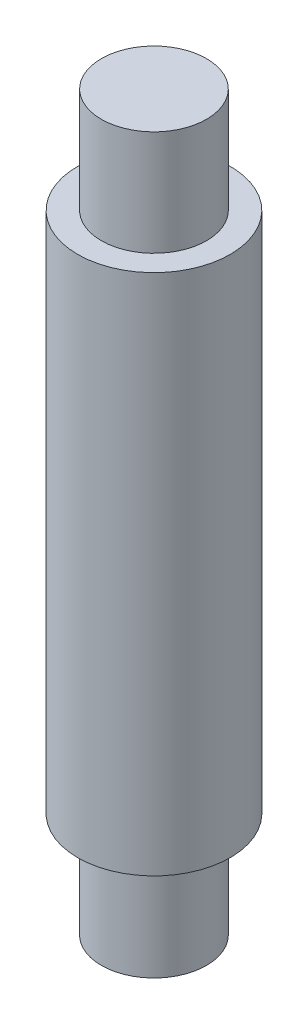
ISO-10303-21;
HEADER;
FILE_DESCRIPTION(('STEP AP214'),'2;1');
FILE_NAME('part.step','',(''),(''),'','','');
FILE_SCHEMA(('AUTOMOTIVE_DESIGN { 1 0 10303 214 1 1 1 1 }'));
ENDSEC;
DATA;
#1=APPLICATION_CONTEXT('core data for automotive mechanical design processes');
#2=APPLICATION_PROTOCOL_DEFINITION('international standard','automotive_design',2000,#1);
#3=PRODUCT_CONTEXT('',#1,'mechanical');
#4=PRODUCT('Part','Part','',(#3));
#5=PRODUCT_RELATED_PRODUCT_CATEGORY('part','',(#4));
#6=PRODUCT_DEFINITION_FORMATION('','',#4);
#7=PRODUCT_DEFINITION_CONTEXT('part definition',#1,'design');
#8=PRODUCT_DEFINITION('design','',#6,#7);
#9=PRODUCT_DEFINITION_SHAPE('','',#8);
#10=(LENGTH_UNIT() NAMED_UNIT(*) SI_UNIT(.MILLI.,.METRE.));
#11=(NAMED_UNIT(*) PLANE_ANGLE_UNIT() SI_UNIT($,.RADIAN.));
#12=(NAMED_UNIT(*) SI_UNIT($,.STERADIAN.) SOLID_ANGLE_UNIT());
#13=UNCERTAINTY_MEASURE_WITH_UNIT(LENGTH_MEASURE(1.E-05),#10,'distance_accuracy_value','');
#14=(GEOMETRIC_REPRESENTATION_CONTEXT(3) GLOBAL_UNCERTAINTY_ASSIGNED_CONTEXT((#13)) GLOBAL_UNIT_ASSIGNED_CONTEXT((#10,
#11,#12)) REPRESENTATION_CONTEXT('',''));
#15=CARTESIAN_POINT('',(0.,0.,0.));
#16=DIRECTION('',(0.,0.,1.));
#17=DIRECTION('',(1.,0.,0.));
#18=AXIS2_PLACEMENT_3D('',#15,#16,#17);
#19=CARTESIAN_POINT('',(0.,-105.094055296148,0.));
#20=DIRECTION('',(0.,1.,0.));
#21=DIRECTION('',(0.,0.,1.));
#22=AXIS2_PLACEMENT_3D('',#19,#20,#21);
#23=PLANE('',#22);
#24=CARTESIAN_POINT('',(0.,-105.094055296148,0.));
#25=DIRECTION('',(0.,1.,0.));
#26=DIRECTION('',(0.,0.,1.));
#27=AXIS2_PLACEMENT_3D('',#24,#25,#26);
#28=CIRCLE('',#27,15.0840879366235);
#29=CARTESIAN_POINT('',(0.,-105.094055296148,15.0840879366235));
#30=VERTEX_POINT('',#29);
#31=EDGE_CURVE('E10',#30,#30,#28,.T.);
#32=ORIENTED_EDGE('',*,*,#31,.F.);
#33=EDGE_LOOP('',(#32));
#34=FACE_BOUND('',#33,.T.);
#35=ADVANCED_FACE('F30',(#34),#23,.F.);
#36=CARTESIAN_POINT('',(0.,112.021820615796,0.));
#37=DIRECTION('',(0.,1.,0.));
#38=DIRECTION('',(0.,0.,1.));
#39=AXIS2_PLACEMENT_3D('',#36,#37,#38);
#40=CYLINDRICAL_SURFACE('',#39,15.0840879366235);
#41=CARTESIAN_POINT('',(0.,-74.9258794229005,0.));
#42=DIRECTION('',(0.,1.,0.));
#43=DIRECTION('',(0.,0.,1.));
#44=AXIS2_PLACEMENT_3D('',#41,#42,#43);
#45=CIRCLE('',#44,15.0840879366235);
#46=CARTESIAN_POINT('',(0.,-74.9258794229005,15.0840879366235));
#47=VERTEX_POINT('',#46);
#48=EDGE_CURVE('E36',#47,#47,#45,.T.);
#49=ORIENTED_EDGE('',*,*,#48,.F.);
#50=EDGE_LOOP('',(#49));
#51=FACE_BOUND('',#50,.T.);
#52=ORIENTED_EDGE('',*,*,#31,.T.);
#53=EDGE_LOOP('',(#52));
#54=FACE_BOUND('',#53,.T.);
#55=ADVANCED_FACE('F78',(#51,#54),#40,.T.);
#56=CARTESIAN_POINT('',(15.0840879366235,-74.9258794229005,0.));
#57=DIRECTION('',(0.,1.,0.));
#58=DIRECTION('',(0.,0.,1.));
#59=AXIS2_PLACEMENT_3D('',#56,#57,#58);
#60=PLANE('',#59);
#61=CARTESIAN_POINT('',(0.,-74.9258794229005,0.));
#62=DIRECTION('',(0.,1.,0.));
#63=DIRECTION('',(0.,0.,1.));
#64=AXIS2_PLACEMENT_3D('',#61,#62,#63);
#65=CIRCLE('',#64,21.8807228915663);
#66=CARTESIAN_POINT('',(0.,-74.9258794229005,21.8807228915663));
#67=VERTEX_POINT('',#66);
#68=EDGE_CURVE('E40',#67,#67,#65,.T.);
#69=ORIENTED_EDGE('',*,*,#68,.F.);
#70=EDGE_LOOP('',(#69));
#71=FACE_BOUND('',#70,.T.);
#72=ORIENTED_EDGE('',*,*,#48,.T.);
#73=EDGE_LOOP('',(#72));
#74=FACE_BOUND('',#73,.T.);
#75=ADVANCED_FACE('F73',(#71,#74),#60,.F.);
#76=CARTESIAN_POINT('',(0.,112.021820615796,0.));
#77=DIRECTION('',(0.,1.,0.));
#78=DIRECTION('',(0.,0.,1.));
#79=AXIS2_PLACEMENT_3D('',#76,#77,#78);
#80=CYLINDRICAL_SURFACE('',#79,21.8807228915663);
#81=CARTESIAN_POINT('',(0.,74.9258794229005,0.));
#82=DIRECTION('',(0.,1.,0.));
#83=DIRECTION('',(0.,0.,1.));
#84=AXIS2_PLACEMENT_3D('',#81,#82,#83);
#85=CIRCLE('',#84,21.8807228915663);
#86=CARTESIAN_POINT('',(0.,74.9258794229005,21.8807228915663));
#87=VERTEX_POINT('',#86);
#88=EDGE_CURVE('E44',#87,#87,#85,.T.);
#89=ORIENTED_EDGE('',*,*,#88,.F.);
#90=EDGE_LOOP('',(#89));
#91=FACE_BOUND('',#90,.T.);
#92=ORIENTED_EDGE('',*,*,#68,.T.);
#93=EDGE_LOOP('',(#92));
#94=FACE_BOUND('',#93,.T.);
#95=ADVANCED_FACE('F67',(#91,#94),#80,.T.);
#96=CARTESIAN_POINT('',(15.0840879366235,74.9258794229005,0.));
#97=DIRECTION('',(0.,-1.,0.));
#98=DIRECTION('',(0.,0.,-1.));
#99=AXIS2_PLACEMENT_3D('',#96,#97,#98);
#100=PLANE('',#99);
#101=CARTESIAN_POINT('',(0.,74.9258794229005,0.));
#102=DIRECTION('',(0.,1.,0.));
#103=DIRECTION('',(0.,0.,1.));
#104=AXIS2_PLACEMENT_3D('',#101,#102,#103);
#105=CIRCLE('',#104,15.0840879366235);
#106=CARTESIAN_POINT('',(0.,74.9258794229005,15.0840879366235));
#107=VERTEX_POINT('',#106);
#108=EDGE_CURVE('E49',#107,#107,#105,.T.);
#109=ORIENTED_EDGE('',*,*,#108,.F.);
#110=EDGE_LOOP('',(#109));
#111=FACE_BOUND('',#110,.T.);
#112=ORIENTED_EDGE('',*,*,#88,.T.);
#113=EDGE_LOOP('',(#112));
#114=FACE_BOUND('',#113,.T.);
#115=ADVANCED_FACE('F61',(#111,#114),#100,.F.);
#116=CARTESIAN_POINT('',(0.,112.021820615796,0.));
#117=DIRECTION('',(0.,1.,0.));
#118=DIRECTION('',(0.,0.,1.));
#119=AXIS2_PLACEMENT_3D('',#116,#117,#118);
#120=CYLINDRICAL_SURFACE('',#119,15.0840879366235);
#121=CARTESIAN_POINT('',(0.,105.094055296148,0.));
#122=DIRECTION('',(0.,1.,0.));
#123=DIRECTION('',(0.,0.,1.));
#124=AXIS2_PLACEMENT_3D('',#121,#122,#123);
#125=CIRCLE('',#124,15.0840879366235);
#126=CARTESIAN_POINT('',(0.,105.094055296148,15.0840879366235));
#127=VERTEX_POINT('',#126);
#128=EDGE_CURVE('E52',#127,#127,#125,.T.);
#129=ORIENTED_EDGE('',*,*,#128,.F.);
#130=EDGE_LOOP('',(#129));
#131=FACE_BOUND('',#130,.T.);
#132=ORIENTED_EDGE('',*,*,#108,.T.);
#133=EDGE_LOOP('',(#132));
#134=FACE_BOUND('',#133,.T.);
#135=ADVANCED_FACE('F58',(#131,#134),#120,.T.);
#136=CARTESIAN_POINT('',(0.,105.094055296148,0.));
#137=DIRECTION('',(0.,-1.,0.));
#138=DIRECTION('',(0.,0.,-1.));
#139=AXIS2_PLACEMENT_3D('',#136,#137,#138);
#140=PLANE('',#139);
#141=ORIENTED_EDGE('',*,*,#128,.T.);
#142=EDGE_LOOP('',(#141));
#143=FACE_BOUND('',#142,.T.);
#144=ADVANCED_FACE('F56',(#143),#140,.F.);
#145=CLOSED_SHELL('',(#35,#55,#75,#95,#115,#135,#144));
#146=MANIFOLD_SOLID_BREP('B2',#145);
#147=ADVANCED_BREP_SHAPE_REPRESENTATION('',(#18,#146),#14);
#148=SHAPE_DEFINITION_REPRESENTATION(#9,#147);
ENDSEC;
END-ISO-10303-21;
